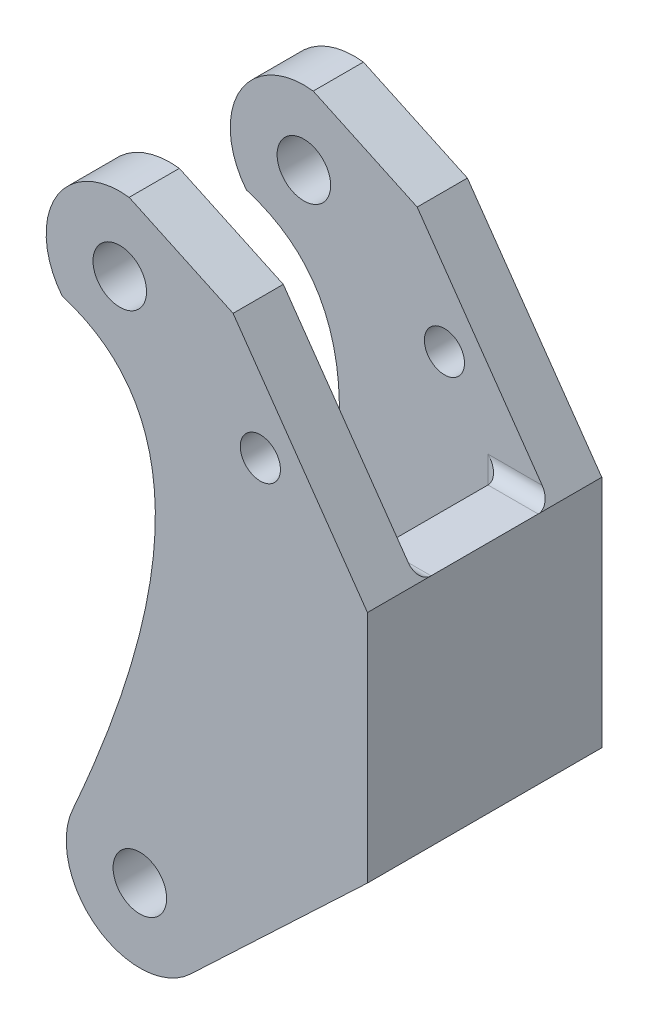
from build123d import *

# Parameters (mm, degrees)
EXTRUSION1_DEPTH        = 35
ESQUISSE3_W             = 20
ESQUISSE3_H             = 39.772251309
ESQUISSE3_H_2           = 28.595906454
ENL_V_MAT_EXTRU_1_DEPTH = 93.574294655
ESQUISSE4_W             = 33.734650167
ESQUISSE4_H             = 20
ENL_V_MAT_EXTRU_2_DEPTH = 93.574294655
ESQUISSE5_R             = 4
ENL_V_MAT_EXTRU_3_DEPTH = 93.574294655
CONG_1_R                = 2
ESQUISSE6_R             = 3
ENL_V_MAT_EXTRU_4_DEPTH = 93.574294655
EXTRUSION2_REACH        = 94.574
EXTRUSION2_END_RADIUS   = 4
ESQUISSE7_R             = 2.5


with BuildPart() as part:
    # Esquisse1 → Extrusion1 (new body)
    with BuildSketch(Plane.XY):
        with BuildLine():
            Line((0, 0), (0, 35))
            Line((0, 35), (-20.075175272, 63.67032155))
            Line((-20.075175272, 63.67032155), (-35.602600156, 70.910878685))
            ThreePointArc((-35.602600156, 70.910878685), (-46.589935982, 65.388239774), (-45.592143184, 53.131588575))
            add(Edge.make_bspline(
                [(-45.592143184, 53.131588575), (-18.585401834, 44.918858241), (-44.033482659, -12.491205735)],
                knots=[0, 0, 0, 1, 1, 1], degree=2))
            ThreePointArc((-44.033482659, -12.491205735), (-40.373066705, -25.965713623), (-26.444059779, -24.994233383))
            Line((-26.444059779, -24.994233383), (0, 0))
        make_face()
    extrude(amount=EXTRUSION1_DEPTH)

    # Esquisse3 → Enl_v. mat.-Extru.1 (cut, through all)
    with BuildSketch(Plane(origin=(0, 0, 0), x_dir=(0, 0, -1), z_dir=(1, 0, 0))):
        with Locations((-17.5, 54.886125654)):
            Rectangle(ESQUISSE3_W, ESQUISSE3_H)
        with Locations((-17.5, -14.297953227)):
            Rectangle(ESQUISSE3_W, ESQUISSE3_H_2)
    extrude(amount=-ENL_V_MAT_EXTRU_1_DEPTH, mode=Mode.SUBTRACT)

    # Esquisse4 → Enl_v. mat.-Extru.2 (cut, through all)
    with BuildSketch(Plane.XZ):
        with Locations((-24.367325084, 17.5)):
            Rectangle(ESQUISSE4_W, ESQUISSE4_H)
    extrude(amount=-ENL_V_MAT_EXTRU_2_DEPTH, mode=Mode.SUBTRACT)

    # Esquisse5 → Enl_v. mat.-Extru.3 (cut, through all)
    with BuildSketch(Plane(origin=(0, 0, 0), x_dir=(-1, 0, 0), z_dir=(0, 0, -1))):
        with Locations((37, 60)):
            Circle(ESQUISSE5_R)
        with Locations((34, -17)):
            Circle(ESQUISSE5_R)
    extrude(amount=-ENL_V_MAT_EXTRU_3_DEPTH, mode=Mode.SUBTRACT)

    # Cong_1
    cong_1_edges = [part.edges().sort_by_distance(p)[0] for p in [
        (-3.75, 0, 7.5),
        (-3.75, 0, 27.5),
        (-3.75, 35, 27.5),
        (-3.75, 35, 7.5),
        (-7.5, 17.5, 27.5),
        (-7.5, 17.5, 7.5),
    ]]
    fillet(cong_1_edges, radius=CONG_1_R)

    # Esquisse6 → Enl_v. mat.-Extru.4 (cut, through all)
    with BuildSketch(Plane.XY.offset(35)):
        with Locations((-16, 47)):
            Circle(ESQUISSE6_R)
    extrude(amount=-ENL_V_MAT_EXTRU_4_DEPTH, mode=Mode.SUBTRACT)

    # Extrusion2: up to this cylinder (the profile starts outside it)
    extrusion2_end = Plane(origin=(-34, -17, 3.75), z_dir=(0, 0, -1)) * Cylinder(EXTRUSION2_END_RADIUS, 198.148, mode=Mode.PRIVATE)
    # Esquisse7 → Extrusion2 (cut, up to the surface)
    with BuildSketch(Plane(origin=(0, 0, 0), x_dir=(0.7267484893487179, 0.6869036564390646, 0), z_dir=(0.6869036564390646, -0.7267484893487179, 0)), mode=Mode.PRIVATE) as extrusion2_sk1:
        with Locations((-36.386810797, 3.75)):
            Circle(ESQUISSE7_R)
    extrusion2_tool1 = extrude(extrusion2_sk1.sketch, amount=-EXTRUSION2_REACH, mode=Mode.PRIVATE) - extrusion2_end
    add(extrusion2_tool1.solids().sort_by_distance((-26.44406, -24.994233, 3.75))[0], mode=Mode.SUBTRACT)


solid = part.part
